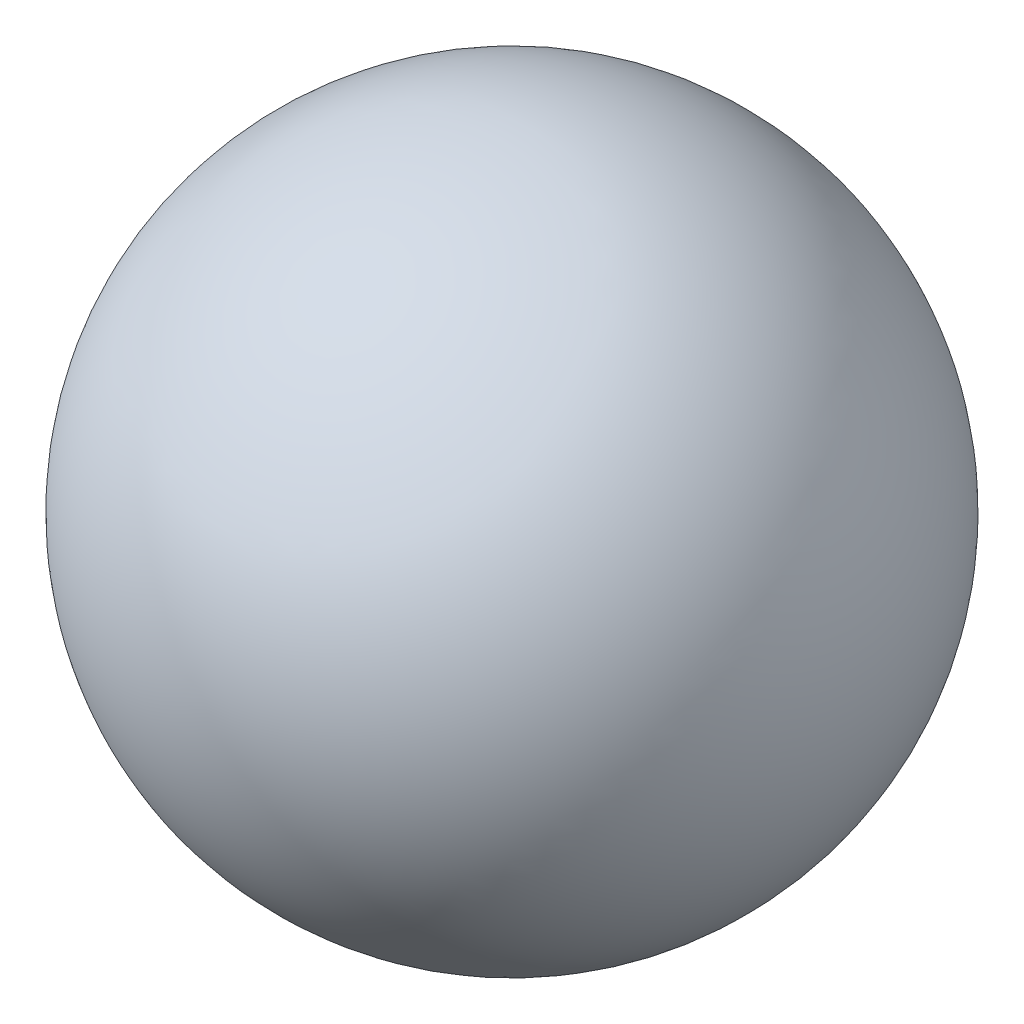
from build123d import *


with BuildPart() as part:
    # Sketch 1 → Revolve 1 (revolve)
    with BuildSketch(Plane(origin=(0, 0, 0), x_dir=(1, 0, 0), z_dir=(0, 1, 0))):
        with BuildLine():
            Line((0, 46.723529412), (0, -33.276470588))
            ThreePointArc((0, -33.276470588), (-40, 6.723529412), (0, 46.723529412))
        make_face()
    revolve(axis=Axis((0, 0, -78.441176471), (0, 0, 1)))


solid = part.part
